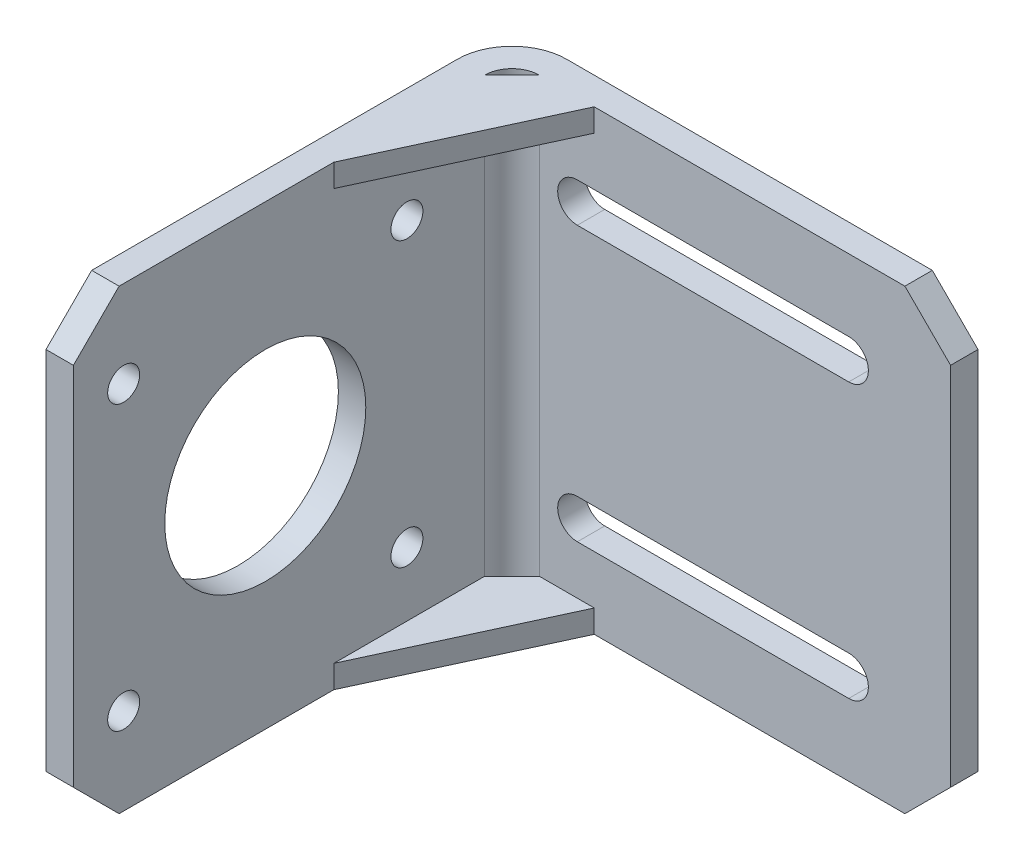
ISO-10303-21;
HEADER;
FILE_DESCRIPTION(('STEP AP214'),'2;1');
FILE_NAME('part.step','',(''),(''),'','','');
FILE_SCHEMA(('AUTOMOTIVE_DESIGN { 1 0 10303 214 1 1 1 1 }'));
ENDSEC;
DATA;
#1=APPLICATION_CONTEXT('core data for automotive mechanical design processes');
#2=APPLICATION_PROTOCOL_DEFINITION('international standard','automotive_design',2000,#1);
#3=PRODUCT_CONTEXT('',#1,'mechanical');
#4=PRODUCT('Part','Part','',(#3));
#5=PRODUCT_RELATED_PRODUCT_CATEGORY('part','',(#4));
#6=PRODUCT_DEFINITION_FORMATION('','',#4);
#7=PRODUCT_DEFINITION_CONTEXT('part definition',#1,'design');
#8=PRODUCT_DEFINITION('design','',#6,#7);
#9=PRODUCT_DEFINITION_SHAPE('','',#8);
#10=(LENGTH_UNIT() NAMED_UNIT(*) SI_UNIT(.MILLI.,.METRE.));
#11=(NAMED_UNIT(*) PLANE_ANGLE_UNIT() SI_UNIT($,.RADIAN.));
#12=(NAMED_UNIT(*) SI_UNIT($,.STERADIAN.) SOLID_ANGLE_UNIT());
#13=UNCERTAINTY_MEASURE_WITH_UNIT(LENGTH_MEASURE(1.E-05),#10,'distance_accuracy_value','');
#14=(GEOMETRIC_REPRESENTATION_CONTEXT(3) GLOBAL_UNCERTAINTY_ASSIGNED_CONTEXT((#13)) GLOBAL_UNIT_ASSIGNED_CONTEXT((#10,
#11,#12)) REPRESENTATION_CONTEXT('',''));
#15=CARTESIAN_POINT('',(0.,0.,0.));
#16=DIRECTION('',(0.,0.,1.));
#17=DIRECTION('',(1.,0.,0.));
#18=AXIS2_PLACEMENT_3D('',#15,#16,#17);
#19=CARTESIAN_POINT('',(0.,22.5,0.));
#20=DIRECTION('',(0.,1.,0.));
#21=DIRECTION('',(1.,0.,0.));
#22=AXIS2_PLACEMENT_3D('',#19,#20,#21);
#23=PLANE('',#22);
#24=DIRECTION('',(-0.419058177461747,0.,0.907959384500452));
#25=VECTOR('',#24,1.);
#26=CARTESIAN_POINT('',(12.,22.5,3.));
#27=LINE('',#26,#25);
#28=CARTESIAN_POINT('',(12.,22.5,3.));
#29=VERTEX_POINT('',#28);
#30=CARTESIAN_POINT('',(3.,22.5,22.5));
#31=VERTEX_POINT('',#30);
#32=EDGE_CURVE('E25',#29,#31,#27,.T.);
#33=ORIENTED_EDGE('',*,*,#32,.T.);
#34=DIRECTION('',(0.,0.,-1.));
#35=VECTOR('',#34,1.);
#36=CARTESIAN_POINT('',(3.,22.5,22.5));
#37=LINE('',#36,#35);
#38=CARTESIAN_POINT('',(3.,22.5,6.));
#39=VERTEX_POINT('',#38);
#40=EDGE_CURVE('E530',#31,#39,#37,.T.);
#41=ORIENTED_EDGE('',*,*,#40,.T.);
#42=DIRECTION('',(0.707106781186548,0.,-0.707106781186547));
#43=VECTOR('',#42,1.);
#44=CARTESIAN_POINT('',(3.,22.5,6.));
#45=LINE('',#44,#43);
#46=CARTESIAN_POINT('',(6.,22.5,3.));
#47=VERTEX_POINT('',#46);
#48=EDGE_CURVE('E10',#39,#47,#45,.T.);
#49=ORIENTED_EDGE('',*,*,#48,.T.);
#50=DIRECTION('',(1.,0.,0.));
#51=VECTOR('',#50,1.);
#52=CARTESIAN_POINT('',(6.,22.5,3.));
#53=LINE('',#52,#51);
#54=EDGE_CURVE('E505',#47,#29,#53,.T.);
#55=ORIENTED_EDGE('',*,*,#54,.T.);
#56=EDGE_LOOP('',(#33,#41,#49,#55));
#57=FACE_BOUND('',#56,.T.);
#58=ADVANCED_FACE('F16',(#57),#23,.F.);
#59=CARTESIAN_POINT('',(3.,22.5,6.));
#60=DIRECTION('',(0.707106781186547,0.,0.707106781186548));
#61=DIRECTION('',(0.,-1.,0.));
#62=AXIS2_PLACEMENT_3D('',#59,#60,#61);
#63=PLANE('',#62);
#64=DIRECTION('',(0.707106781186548,0.,-0.707106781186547));
#65=VECTOR('',#64,1.);
#66=CARTESIAN_POINT('',(3.,25.,6.));
#67=LINE('',#66,#65);
#68=CARTESIAN_POINT('',(3.,25.,6.));
#69=VERTEX_POINT('',#68);
#70=CARTESIAN_POINT('',(6.,25.,3.));
#71=VERTEX_POINT('',#70);
#72=EDGE_CURVE('E392',#69,#71,#67,.T.);
#73=ORIENTED_EDGE('',*,*,#72,.T.);
#74=DIRECTION('',(0.,-1.,0.));
#75=VECTOR('',#74,1.);
#76=CARTESIAN_POINT('',(6.,25.,3.));
#77=LINE('',#76,#75);
#78=EDGE_CURVE('E442',#71,#47,#77,.T.);
#79=ORIENTED_EDGE('',*,*,#78,.T.);
#80=ORIENTED_EDGE('',*,*,#48,.F.);
#81=DIRECTION('',(0.,-1.,0.));
#82=VECTOR('',#81,1.);
#83=CARTESIAN_POINT('',(3.,25.,6.));
#84=LINE('',#83,#82);
#85=EDGE_CURVE('E446',#69,#39,#84,.T.);
#86=ORIENTED_EDGE('',*,*,#85,.F.);
#87=EDGE_LOOP('',(#73,#79,#80,#86));
#88=FACE_BOUND('',#87,.T.);
#89=ADVANCED_FACE('F671',(#88),#63,.F.);
#90=CARTESIAN_POINT('',(12.,22.5,3.));
#91=DIRECTION('',(-0.907959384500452,0.,-0.419058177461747));
#92=DIRECTION('',(-0.419058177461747,0.,0.907959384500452));
#93=AXIS2_PLACEMENT_3D('',#90,#91,#92);
#94=PLANE('',#93);
#95=DIRECTION('',(-0.419058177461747,0.,0.907959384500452));
#96=VECTOR('',#95,1.);
#97=CARTESIAN_POINT('',(12.,25.,3.));
#98=LINE('',#97,#96);
#99=CARTESIAN_POINT('',(12.,25.,3.));
#100=VERTEX_POINT('',#99);
#101=CARTESIAN_POINT('',(3.,25.,22.5));
#102=VERTEX_POINT('',#101);
#103=EDGE_CURVE('E381',#100,#102,#98,.T.);
#104=ORIENTED_EDGE('',*,*,#103,.T.);
#105=DIRECTION('',(0.,1.,0.));
#106=VECTOR('',#105,1.);
#107=CARTESIAN_POINT('',(3.,22.5,22.5));
#108=LINE('',#107,#106);
#109=EDGE_CURVE('E534',#31,#102,#108,.T.);
#110=ORIENTED_EDGE('',*,*,#109,.F.);
#111=ORIENTED_EDGE('',*,*,#32,.F.);
#112=DIRECTION('',(0.,1.,0.));
#113=VECTOR('',#112,1.);
#114=CARTESIAN_POINT('',(12.,22.5,3.));
#115=LINE('',#114,#113);
#116=EDGE_CURVE('E628',#29,#100,#115,.T.);
#117=ORIENTED_EDGE('',*,*,#116,.T.);
#118=EDGE_LOOP('',(#104,#110,#111,#117));
#119=FACE_BOUND('',#118,.T.);
#120=ADVANCED_FACE('F657',(#119),#94,.F.);
#121=CARTESIAN_POINT('',(0.,-22.5,0.));
#122=DIRECTION('',(0.,-1.,0.));
#123=DIRECTION('',(0.,0.,-1.));
#124=AXIS2_PLACEMENT_3D('',#121,#122,#123);
#125=PLANE('',#124);
#126=DIRECTION('',(0.,0.,1.));
#127=VECTOR('',#126,1.);
#128=CARTESIAN_POINT('',(3.,-22.5,6.));
#129=LINE('',#128,#127);
#130=CARTESIAN_POINT('',(3.,-22.5,6.));
#131=VERTEX_POINT('',#130);
#132=CARTESIAN_POINT('',(3.,-22.5,22.5));
#133=VERTEX_POINT('',#132);
#134=EDGE_CURVE('E323',#131,#133,#129,.T.);
#135=ORIENTED_EDGE('',*,*,#134,.T.);
#136=DIRECTION('',(0.419058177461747,0.,-0.907959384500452));
#137=VECTOR('',#136,1.);
#138=CARTESIAN_POINT('',(3.,-22.5,22.5));
#139=LINE('',#138,#137);
#140=CARTESIAN_POINT('',(12.,-22.5,3.));
#141=VERTEX_POINT('',#140);
#142=EDGE_CURVE('E19',#133,#141,#139,.T.);
#143=ORIENTED_EDGE('',*,*,#142,.T.);
#144=DIRECTION('',(-1.,0.,0.));
#145=VECTOR('',#144,1.);
#146=CARTESIAN_POINT('',(12.,-22.5,3.));
#147=LINE('',#146,#145);
#148=CARTESIAN_POINT('',(6.,-22.5,3.));
#149=VERTEX_POINT('',#148);
#150=EDGE_CURVE('E479',#141,#149,#147,.T.);
#151=ORIENTED_EDGE('',*,*,#150,.T.);
#152=DIRECTION('',(-0.707106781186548,0.,0.707106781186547));
#153=VECTOR('',#152,1.);
#154=CARTESIAN_POINT('',(6.,-22.5,3.));
#155=LINE('',#154,#153);
#156=EDGE_CURVE('E431',#149,#131,#155,.T.);
#157=ORIENTED_EDGE('',*,*,#156,.T.);
#158=EDGE_LOOP('',(#135,#143,#151,#157));
#159=FACE_BOUND('',#158,.T.);
#160=ADVANCED_FACE('F477',(#159),#125,.F.);
#161=CARTESIAN_POINT('',(6.,-22.5,3.));
#162=DIRECTION('',(0.707106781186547,0.,0.707106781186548));
#163=DIRECTION('',(0.,-1.,0.));
#164=AXIS2_PLACEMENT_3D('',#161,#162,#163);
#165=PLANE('',#164);
#166=DIRECTION('',(-0.707106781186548,0.,0.707106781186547));
#167=VECTOR('',#166,1.);
#168=CARTESIAN_POINT('',(6.,-25.,3.));
#169=LINE('',#168,#167);
#170=CARTESIAN_POINT('',(6.,-25.,3.));
#171=VERTEX_POINT('',#170);
#172=CARTESIAN_POINT('',(3.,-25.,6.));
#173=VERTEX_POINT('',#172);
#174=EDGE_CURVE('E405',#171,#173,#169,.T.);
#175=ORIENTED_EDGE('',*,*,#174,.T.);
#176=DIRECTION('',(0.,-1.,0.));
#177=VECTOR('',#176,1.);
#178=CARTESIAN_POINT('',(3.,-22.5,6.));
#179=LINE('',#178,#177);
#180=EDGE_CURVE('E299',#131,#173,#179,.T.);
#181=ORIENTED_EDGE('',*,*,#180,.F.);
#182=ORIENTED_EDGE('',*,*,#156,.F.);
#183=DIRECTION('',(0.,-1.,0.));
#184=VECTOR('',#183,1.);
#185=CARTESIAN_POINT('',(6.,-22.5,3.));
#186=LINE('',#185,#184);
#187=EDGE_CURVE('E439',#149,#171,#186,.T.);
#188=ORIENTED_EDGE('',*,*,#187,.T.);
#189=EDGE_LOOP('',(#175,#181,#182,#188));
#190=FACE_BOUND('',#189,.T.);
#191=ADVANCED_FACE('F693',(#190),#165,.F.);
#192=CARTESIAN_POINT('',(3.,-22.5,22.5));
#193=DIRECTION('',(-0.907959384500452,0.,-0.419058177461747));
#194=DIRECTION('',(-0.419058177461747,0.,0.907959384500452));
#195=AXIS2_PLACEMENT_3D('',#192,#193,#194);
#196=PLANE('',#195);
#197=DIRECTION('',(0.419058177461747,0.,-0.907959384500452));
#198=VECTOR('',#197,1.);
#199=CARTESIAN_POINT('',(3.,-25.,22.5));
#200=LINE('',#199,#198);
#201=CARTESIAN_POINT('',(3.,-25.,22.5));
#202=VERTEX_POINT('',#201);
#203=CARTESIAN_POINT('',(12.,-25.,3.));
#204=VERTEX_POINT('',#203);
#205=EDGE_CURVE('E330',#202,#204,#200,.T.);
#206=ORIENTED_EDGE('',*,*,#205,.T.);
#207=DIRECTION('',(0.,-1.,0.));
#208=VECTOR('',#207,1.);
#209=CARTESIAN_POINT('',(12.,-22.5,3.));
#210=LINE('',#209,#208);
#211=EDGE_CURVE('E486',#141,#204,#210,.T.);
#212=ORIENTED_EDGE('',*,*,#211,.F.);
#213=ORIENTED_EDGE('',*,*,#142,.F.);
#214=DIRECTION('',(0.,-1.,0.));
#215=VECTOR('',#214,1.);
#216=CARTESIAN_POINT('',(3.,-22.5,22.5));
#217=LINE('',#216,#215);
#218=EDGE_CURVE('E575',#133,#202,#217,.T.);
#219=ORIENTED_EDGE('',*,*,#218,.T.);
#220=EDGE_LOOP('',(#206,#212,#213,#219));
#221=FACE_BOUND('',#220,.T.);
#222=ADVANCED_FACE('F487',(#221),#196,.F.);
#223=CARTESIAN_POINT('',(10.15,15.,-84.7610391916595));
#224=DIRECTION('',(0.,0.,1.));
#225=DIRECTION('',(1.,0.,0.));
#226=AXIS2_PLACEMENT_3D('',#223,#224,#225);
#227=CYLINDRICAL_SURFACE('',#226,2.15);
#228=DIRECTION('',(0.,0.,1.));
#229=VECTOR('',#228,1.);
#230=CARTESIAN_POINT('',(10.15,17.15,-84.7610391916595));
#231=LINE('',#230,#229);
#232=CARTESIAN_POINT('',(10.15,17.15,0.));
#233=VERTEX_POINT('',#232);
#234=CARTESIAN_POINT('',(10.15,17.15,3.));
#235=VERTEX_POINT('',#234);
#236=EDGE_CURVE('E463',#233,#235,#231,.T.);
#237=ORIENTED_EDGE('',*,*,#236,.T.);
#238=CARTESIAN_POINT('',(10.15,15.,3.));
#239=DIRECTION('',(0.,0.,-1.));
#240=DIRECTION('',(0.,-1.,0.));
#241=AXIS2_PLACEMENT_3D('',#238,#239,#240);
#242=CIRCLE('',#241,2.15);
#243=CARTESIAN_POINT('',(10.15,12.85,3.));
#244=VERTEX_POINT('',#243);
#245=EDGE_CURVE('E641',#244,#235,#242,.T.);
#246=ORIENTED_EDGE('',*,*,#245,.F.);
#247=DIRECTION('',(0.,0.,1.));
#248=VECTOR('',#247,1.);
#249=CARTESIAN_POINT('',(10.15,12.85,-84.7610391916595));
#250=LINE('',#249,#248);
#251=CARTESIAN_POINT('',(10.15,12.85,0.));
#252=VERTEX_POINT('',#251);
#253=EDGE_CURVE('E363',#252,#244,#250,.T.);
#254=ORIENTED_EDGE('',*,*,#253,.F.);
#255=CARTESIAN_POINT('',(10.15,15.,0.));
#256=DIRECTION('',(0.,0.,1.));
#257=DIRECTION('',(-1.,0.,0.));
#258=AXIS2_PLACEMENT_3D('',#255,#256,#257);
#259=CIRCLE('',#258,2.15);
#260=EDGE_CURVE('E372',#233,#252,#259,.T.);
#261=ORIENTED_EDGE('',*,*,#260,.F.);
#262=EDGE_LOOP('',(#237,#246,#254,#261));
#263=FACE_BOUND('',#262,.T.);
#264=ADVANCED_FACE('F699',(#263),#227,.F.);
#265=CARTESIAN_POINT('',(10.15,17.15,-84.7610391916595));
#266=DIRECTION('',(0.,-1.,0.));
#267=DIRECTION('',(-1.,0.,0.));
#268=AXIS2_PLACEMENT_3D('',#265,#266,#267);
#269=PLANE('',#268);
#270=DIRECTION('',(0.,0.,1.));
#271=VECTOR('',#270,1.);
#272=CARTESIAN_POINT('',(39.85,17.15,-84.7610391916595));
#273=LINE('',#272,#271);
#274=CARTESIAN_POINT('',(39.85,17.15,0.));
#275=VERTEX_POINT('',#274);
#276=CARTESIAN_POINT('',(39.85,17.15,3.));
#277=VERTEX_POINT('',#276);
#278=EDGE_CURVE('E461',#275,#277,#273,.T.);
#279=ORIENTED_EDGE('',*,*,#278,.T.);
#280=DIRECTION('',(1.,0.,0.));
#281=VECTOR('',#280,1.);
#282=CARTESIAN_POINT('',(10.15,17.15,3.));
#283=LINE('',#282,#281);
#284=EDGE_CURVE('E630',#235,#277,#283,.T.);
#285=ORIENTED_EDGE('',*,*,#284,.F.);
#286=ORIENTED_EDGE('',*,*,#236,.F.);
#287=DIRECTION('',(-1.,0.,0.));
#288=VECTOR('',#287,1.);
#289=CARTESIAN_POINT('',(0.,17.15,0.));
#290=LINE('',#289,#288);
#291=EDGE_CURVE('E368',#275,#233,#290,.T.);
#292=ORIENTED_EDGE('',*,*,#291,.F.);
#293=EDGE_LOOP('',(#279,#285,#286,#292));
#294=FACE_BOUND('',#293,.T.);
#295=ADVANCED_FACE('F702',(#294),#269,.T.);
#296=CARTESIAN_POINT('',(39.85,15.,-84.7610391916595));
#297=DIRECTION('',(0.,0.,1.));
#298=DIRECTION('',(1.,0.,0.));
#299=AXIS2_PLACEMENT_3D('',#296,#297,#298);
#300=CYLINDRICAL_SURFACE('',#299,2.15);
#301=DIRECTION('',(0.,0.,1.));
#302=VECTOR('',#301,1.);
#303=CARTESIAN_POINT('',(39.85,12.85,-84.7610391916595));
#304=LINE('',#303,#302);
#305=CARTESIAN_POINT('',(39.85,12.85,0.));
#306=VERTEX_POINT('',#305);
#307=CARTESIAN_POINT('',(39.85,12.85,3.));
#308=VERTEX_POINT('',#307);
#309=EDGE_CURVE('E366',#306,#308,#304,.T.);
#310=ORIENTED_EDGE('',*,*,#309,.T.);
#311=CARTESIAN_POINT('',(39.85,15.,3.));
#312=DIRECTION('',(0.,0.,-1.));
#313=DIRECTION('',(0.,1.,0.));
#314=AXIS2_PLACEMENT_3D('',#311,#312,#313);
#315=CIRCLE('',#314,2.15);
#316=EDGE_CURVE('E627',#277,#308,#315,.T.);
#317=ORIENTED_EDGE('',*,*,#316,.F.);
#318=ORIENTED_EDGE('',*,*,#278,.F.);
#319=CARTESIAN_POINT('',(39.85,15.,0.));
#320=DIRECTION('',(0.,0.,1.));
#321=DIRECTION('',(-1.,0.,0.));
#322=AXIS2_PLACEMENT_3D('',#319,#320,#321);
#323=CIRCLE('',#322,2.15);
#324=EDGE_CURVE('E373',#306,#275,#323,.T.);
#325=ORIENTED_EDGE('',*,*,#324,.F.);
#326=EDGE_LOOP('',(#310,#317,#318,#325));
#327=FACE_BOUND('',#326,.T.);
#328=ADVANCED_FACE('F705',(#327),#300,.F.);
#329=CARTESIAN_POINT('',(10.15,12.85,-84.7610391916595));
#330=DIRECTION('',(0.,-1.,0.));
#331=DIRECTION('',(-1.,0.,0.));
#332=AXIS2_PLACEMENT_3D('',#329,#330,#331);
#333=PLANE('',#332);
#334=DIRECTION('',(-1.,0.,0.));
#335=VECTOR('',#334,1.);
#336=CARTESIAN_POINT('',(0.,12.85,0.));
#337=LINE('',#336,#335);
#338=EDGE_CURVE('E362',#306,#252,#337,.T.);
#339=ORIENTED_EDGE('',*,*,#338,.T.);
#340=ORIENTED_EDGE('',*,*,#253,.T.);
#341=DIRECTION('',(1.,0.,0.));
#342=VECTOR('',#341,1.);
#343=CARTESIAN_POINT('',(10.15,12.85,3.));
#344=LINE('',#343,#342);
#345=EDGE_CURVE('E634',#244,#308,#344,.T.);
#346=ORIENTED_EDGE('',*,*,#345,.T.);
#347=ORIENTED_EDGE('',*,*,#309,.F.);
#348=EDGE_LOOP('',(#339,#340,#346,#347));
#349=FACE_BOUND('',#348,.T.);
#350=ADVANCED_FACE('F709',(#349),#333,.F.);
#351=CARTESIAN_POINT('',(10.15,-15.,-84.7610391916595));
#352=DIRECTION('',(0.,0.,1.));
#353=DIRECTION('',(1.,0.,0.));
#354=AXIS2_PLACEMENT_3D('',#351,#352,#353);
#355=CYLINDRICAL_SURFACE('',#354,2.15);
#356=DIRECTION('',(0.,0.,1.));
#357=VECTOR('',#356,1.);
#358=CARTESIAN_POINT('',(10.15,-12.85,-84.7610391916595));
#359=LINE('',#358,#357);
#360=CARTESIAN_POINT('',(10.15,-12.85,0.));
#361=VERTEX_POINT('',#360);
#362=CARTESIAN_POINT('',(10.15,-12.85,3.));
#363=VERTEX_POINT('',#362);
#364=EDGE_CURVE('E367',#361,#363,#359,.T.);
#365=ORIENTED_EDGE('',*,*,#364,.T.);
#366=CARTESIAN_POINT('',(10.15,-15.,3.));
#367=DIRECTION('',(0.,0.,-1.));
#368=DIRECTION('',(0.,-1.,0.));
#369=AXIS2_PLACEMENT_3D('',#366,#367,#368);
#370=CIRCLE('',#369,2.15);
#371=CARTESIAN_POINT('',(10.15,-17.15,3.));
#372=VERTEX_POINT('',#371);
#373=EDGE_CURVE('E292',#372,#363,#370,.T.);
#374=ORIENTED_EDGE('',*,*,#373,.F.);
#375=DIRECTION('',(0.,0.,1.));
#376=VECTOR('',#375,1.);
#377=CARTESIAN_POINT('',(10.15,-17.15,-84.7610391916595));
#378=LINE('',#377,#376);
#379=CARTESIAN_POINT('',(10.15,-17.15,0.));
#380=VERTEX_POINT('',#379);
#381=EDGE_CURVE('E286',#380,#372,#378,.T.);
#382=ORIENTED_EDGE('',*,*,#381,.F.);
#383=CARTESIAN_POINT('',(10.15,-15.,0.));
#384=DIRECTION('',(0.,0.,1.));
#385=DIRECTION('',(-1.,0.,0.));
#386=AXIS2_PLACEMENT_3D('',#383,#384,#385);
#387=CIRCLE('',#386,2.15);
#388=EDGE_CURVE('E289',#361,#380,#387,.T.);
#389=ORIENTED_EDGE('',*,*,#388,.F.);
#390=EDGE_LOOP('',(#365,#374,#382,#389));
#391=FACE_BOUND('',#390,.T.);
#392=ADVANCED_FACE('F288',(#391),#355,.F.);
#393=CARTESIAN_POINT('',(10.15,-12.85,-84.7610391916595));
#394=DIRECTION('',(0.,-1.,0.));
#395=DIRECTION('',(0.,0.,-1.));
#396=AXIS2_PLACEMENT_3D('',#393,#394,#395);
#397=PLANE('',#396);
#398=DIRECTION('',(0.,0.,1.));
#399=VECTOR('',#398,1.);
#400=CARTESIAN_POINT('',(39.85,-12.85,-84.7610391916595));
#401=LINE('',#400,#399);
#402=CARTESIAN_POINT('',(39.85,-12.85,0.));
#403=VERTEX_POINT('',#402);
#404=CARTESIAN_POINT('',(39.85,-12.85,3.));
#405=VERTEX_POINT('',#404);
#406=EDGE_CURVE('E454',#403,#405,#401,.T.);
#407=ORIENTED_EDGE('',*,*,#406,.T.);
#408=DIRECTION('',(1.,0.,0.));
#409=VECTOR('',#408,1.);
#410=CARTESIAN_POINT('',(10.15,-12.85,3.));
#411=LINE('',#410,#409);
#412=EDGE_CURVE('E623',#363,#405,#411,.T.);
#413=ORIENTED_EDGE('',*,*,#412,.F.);
#414=ORIENTED_EDGE('',*,*,#364,.F.);
#415=DIRECTION('',(-1.,0.,0.));
#416=VECTOR('',#415,1.);
#417=CARTESIAN_POINT('',(0.,-12.85,0.));
#418=LINE('',#417,#416);
#419=EDGE_CURVE('E307',#403,#361,#418,.T.);
#420=ORIENTED_EDGE('',*,*,#419,.F.);
#421=EDGE_LOOP('',(#407,#413,#414,#420));
#422=FACE_BOUND('',#421,.T.);
#423=ADVANCED_FACE('F714',(#422),#397,.T.);
#424=CARTESIAN_POINT('',(39.85,-15.,-84.7610391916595));
#425=DIRECTION('',(0.,0.,1.));
#426=DIRECTION('',(1.,0.,0.));
#427=AXIS2_PLACEMENT_3D('',#424,#425,#426);
#428=CYLINDRICAL_SURFACE('',#427,2.15);
#429=DIRECTION('',(0.,0.,1.));
#430=VECTOR('',#429,1.);
#431=CARTESIAN_POINT('',(39.85,-17.15,-84.7610391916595));
#432=LINE('',#431,#430);
#433=CARTESIAN_POINT('',(39.85,-17.15,0.));
#434=VERTEX_POINT('',#433);
#435=CARTESIAN_POINT('',(39.85,-17.15,3.));
#436=VERTEX_POINT('',#435);
#437=EDGE_CURVE('E298',#434,#436,#432,.T.);
#438=ORIENTED_EDGE('',*,*,#437,.T.);
#439=CARTESIAN_POINT('',(39.85,-15.,3.));
#440=DIRECTION('',(0.,0.,-1.));
#441=DIRECTION('',(0.,1.,0.));
#442=AXIS2_PLACEMENT_3D('',#439,#440,#441);
#443=CIRCLE('',#442,2.15);
#444=EDGE_CURVE('E1000',#405,#436,#443,.T.);
#445=ORIENTED_EDGE('',*,*,#444,.F.);
#446=ORIENTED_EDGE('',*,*,#406,.F.);
#447=CARTESIAN_POINT('',(39.85,-15.,0.));
#448=DIRECTION('',(0.,0.,1.));
#449=DIRECTION('',(-1.,0.,0.));
#450=AXIS2_PLACEMENT_3D('',#447,#448,#449);
#451=CIRCLE('',#450,2.15);
#452=EDGE_CURVE('E314',#434,#403,#451,.T.);
#453=ORIENTED_EDGE('',*,*,#452,.F.);
#454=EDGE_LOOP('',(#438,#445,#446,#453));
#455=FACE_BOUND('',#454,.T.);
#456=ADVANCED_FACE('F717',(#455),#428,.F.);
#457=CARTESIAN_POINT('',(10.15,-17.15,-84.7610391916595));
#458=DIRECTION('',(0.,-1.,0.));
#459=DIRECTION('',(0.,0.,-1.));
#460=AXIS2_PLACEMENT_3D('',#457,#458,#459);
#461=PLANE('',#460);
#462=DIRECTION('',(-1.,0.,0.));
#463=VECTOR('',#462,1.);
#464=CARTESIAN_POINT('',(0.,-17.15,0.));
#465=LINE('',#464,#463);
#466=EDGE_CURVE('E305',#434,#380,#465,.T.);
#467=ORIENTED_EDGE('',*,*,#466,.T.);
#468=ORIENTED_EDGE('',*,*,#381,.T.);
#469=DIRECTION('',(1.,0.,0.));
#470=VECTOR('',#469,1.);
#471=CARTESIAN_POINT('',(10.15,-17.15,3.));
#472=LINE('',#471,#470);
#473=EDGE_CURVE('E1002',#372,#436,#472,.T.);
#474=ORIENTED_EDGE('',*,*,#473,.T.);
#475=ORIENTED_EDGE('',*,*,#437,.F.);
#476=EDGE_LOOP('',(#467,#468,#474,#475));
#477=FACE_BOUND('',#476,.T.);
#478=ADVANCED_FACE('F311',(#477),#461,.F.);
#479=CARTESIAN_POINT('',(0.,20.,51.));
#480=DIRECTION('',(0.,0.707106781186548,0.707106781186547));
#481=DIRECTION('',(1.,0.,0.));
#482=AXIS2_PLACEMENT_3D('',#479,#480,#481);
#483=PLANE('',#482);
#484=DIRECTION('',(0.,-0.707106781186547,0.707106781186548));
#485=VECTOR('',#484,1.);
#486=CARTESIAN_POINT('',(3.,20.,51.));
#487=LINE('',#486,#485);
#488=CARTESIAN_POINT('',(3.,25.,46.));
#489=VERTEX_POINT('',#488);
#490=CARTESIAN_POINT('',(3.,20.,51.));
#491=VERTEX_POINT('',#490);
#492=EDGE_CURVE('E545',#489,#491,#487,.T.);
#493=ORIENTED_EDGE('',*,*,#492,.F.);
#494=DIRECTION('',(1.,0.,0.));
#495=VECTOR('',#494,1.);
#496=CARTESIAN_POINT('',(0.,25.,46.));
#497=LINE('',#496,#495);
#498=CARTESIAN_POINT('',(0.,25.,46.));
#499=VERTEX_POINT('',#498);
#500=EDGE_CURVE('E344',#499,#489,#497,.T.);
#501=ORIENTED_EDGE('',*,*,#500,.F.);
#502=DIRECTION('',(0.,0.707106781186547,-0.707106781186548));
#503=VECTOR('',#502,1.);
#504=CARTESIAN_POINT('',(0.,48.,23.));
#505=LINE('',#504,#503);
#506=CARTESIAN_POINT('',(0.,20.,51.));
#507=VERTEX_POINT('',#506);
#508=EDGE_CURVE('E438',#507,#499,#505,.T.);
#509=ORIENTED_EDGE('',*,*,#508,.F.);
#510=DIRECTION('',(-1.,0.,0.));
#511=VECTOR('',#510,1.);
#512=CARTESIAN_POINT('',(0.,20.,51.));
#513=LINE('',#512,#511);
#514=EDGE_CURVE('E423',#491,#507,#513,.T.);
#515=ORIENTED_EDGE('',*,*,#514,.F.);
#516=EDGE_LOOP('',(#493,#501,#509,#515));
#517=FACE_BOUND('',#516,.T.);
#518=ADVANCED_FACE('F726',(#517),#483,.T.);
#519=CARTESIAN_POINT('',(0.,-25.,46.));
#520=DIRECTION('',(0.,0.707106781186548,-0.707106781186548));
#521=DIRECTION('',(-1.,0.,0.));
#522=AXIS2_PLACEMENT_3D('',#519,#520,#521);
#523=PLANE('',#522);
#524=DIRECTION('',(0.,-0.707106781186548,-0.707106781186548));
#525=VECTOR('',#524,1.);
#526=CARTESIAN_POINT('',(3.,-25.,46.));
#527=LINE('',#526,#525);
#528=CARTESIAN_POINT('',(3.,-20.,51.));
#529=VERTEX_POINT('',#528);
#530=CARTESIAN_POINT('',(3.,-25.,46.));
#531=VERTEX_POINT('',#530);
#532=EDGE_CURVE('E562',#529,#531,#527,.T.);
#533=ORIENTED_EDGE('',*,*,#532,.F.);
#534=DIRECTION('',(1.,0.,0.));
#535=VECTOR('',#534,1.);
#536=CARTESIAN_POINT('',(0.,-20.,51.));
#537=LINE('',#536,#535);
#538=CARTESIAN_POINT('',(0.,-20.,51.));
#539=VERTEX_POINT('',#538);
#540=EDGE_CURVE('E420',#539,#529,#537,.T.);
#541=ORIENTED_EDGE('',*,*,#540,.F.);
#542=DIRECTION('',(0.,0.707106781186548,0.707106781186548));
#543=VECTOR('',#542,1.);
#544=CARTESIAN_POINT('',(0.,-23.,48.));
#545=LINE('',#544,#543);
#546=CARTESIAN_POINT('',(0.,-25.,46.));
#547=VERTEX_POINT('',#546);
#548=EDGE_CURVE('E426',#547,#539,#545,.T.);
#549=ORIENTED_EDGE('',*,*,#548,.F.);
#550=DIRECTION('',(-1.,0.,0.));
#551=VECTOR('',#550,1.);
#552=CARTESIAN_POINT('',(0.,-25.,46.));
#553=LINE('',#552,#551);
#554=EDGE_CURVE('E333',#531,#547,#553,.T.);
#555=ORIENTED_EDGE('',*,*,#554,.F.);
#556=EDGE_LOOP('',(#533,#541,#549,#555));
#557=FACE_BOUND('',#556,.T.);
#558=ADVANCED_FACE('F729',(#557),#523,.F.);
#559=CARTESIAN_POINT('',(51.,-20.,0.));
#560=DIRECTION('',(0.707106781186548,-0.707106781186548,0.));
#561=DIRECTION('',(0.,0.,-1.));
#562=AXIS2_PLACEMENT_3D('',#559,#560,#561);
#563=PLANE('',#562);
#564=DIRECTION('',(0.707106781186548,0.707106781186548,0.));
#565=VECTOR('',#564,1.);
#566=CARTESIAN_POINT('',(51.,-20.,3.));
#567=LINE('',#566,#565);
#568=CARTESIAN_POINT('',(46.,-25.,3.));
#569=VERTEX_POINT('',#568);
#570=CARTESIAN_POINT('',(51.,-20.,3.));
#571=VERTEX_POINT('',#570);
#572=EDGE_CURVE('E610',#569,#571,#567,.T.);
#573=ORIENTED_EDGE('',*,*,#572,.F.);
#574=DIRECTION('',(0.,0.,1.));
#575=VECTOR('',#574,1.);
#576=CARTESIAN_POINT('',(46.,-25.,0.));
#577=LINE('',#576,#575);
#578=CARTESIAN_POINT('',(46.,-25.,0.));
#579=VERTEX_POINT('',#578);
#580=EDGE_CURVE('E410',#579,#569,#577,.T.);
#581=ORIENTED_EDGE('',*,*,#580,.F.);
#582=DIRECTION('',(-0.707106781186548,-0.707106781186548,0.));
#583=VECTOR('',#582,1.);
#584=CARTESIAN_POINT('',(48.,-23.,0.));
#585=LINE('',#584,#583);
#586=CARTESIAN_POINT('',(51.,-20.,0.));
#587=VERTEX_POINT('',#586);
#588=EDGE_CURVE('E353',#587,#579,#585,.T.);
#589=ORIENTED_EDGE('',*,*,#588,.F.);
#590=DIRECTION('',(0.,0.,-1.));
#591=VECTOR('',#590,1.);
#592=CARTESIAN_POINT('',(51.,-20.,0.));
#593=LINE('',#592,#591);
#594=EDGE_CURVE('E334',#571,#587,#593,.T.);
#595=ORIENTED_EDGE('',*,*,#594,.F.);
#596=EDGE_LOOP('',(#573,#581,#589,#595));
#597=FACE_BOUND('',#596,.T.);
#598=ADVANCED_FACE('F596',(#597),#563,.T.);
#599=CARTESIAN_POINT('',(46.,25.,0.));
#600=DIRECTION('',(-0.707106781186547,-0.707106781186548,0.));
#601=DIRECTION('',(-0.707106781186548,0.707106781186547,0.));
#602=AXIS2_PLACEMENT_3D('',#599,#600,#601);
#603=PLANE('',#602);
#604=DIRECTION('',(-0.707106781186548,0.707106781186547,0.));
#605=VECTOR('',#604,1.);
#606=CARTESIAN_POINT('',(46.,25.,3.));
#607=LINE('',#606,#605);
#608=CARTESIAN_POINT('',(51.,20.,3.));
#609=VERTEX_POINT('',#608);
#610=CARTESIAN_POINT('',(46.,25.,3.));
#611=VERTEX_POINT('',#610);
#612=EDGE_CURVE('E511',#609,#611,#607,.T.);
#613=ORIENTED_EDGE('',*,*,#612,.F.);
#614=DIRECTION('',(0.,0.,1.));
#615=VECTOR('',#614,1.);
#616=CARTESIAN_POINT('',(51.,20.,0.));
#617=LINE('',#616,#615);
#618=CARTESIAN_POINT('',(51.,20.,0.));
#619=VERTEX_POINT('',#618);
#620=EDGE_CURVE('E396',#619,#609,#617,.T.);
#621=ORIENTED_EDGE('',*,*,#620,.F.);
#622=DIRECTION('',(0.707106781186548,-0.707106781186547,0.));
#623=VECTOR('',#622,1.);
#624=CARTESIAN_POINT('',(23.,48.,0.));
#625=LINE('',#624,#623);
#626=CARTESIAN_POINT('',(46.,25.,0.));
#627=VERTEX_POINT('',#626);
#628=EDGE_CURVE('E338',#627,#619,#625,.T.);
#629=ORIENTED_EDGE('',*,*,#628,.F.);
#630=DIRECTION('',(0.,0.,-1.));
#631=VECTOR('',#630,1.);
#632=CARTESIAN_POINT('',(46.,25.,0.));
#633=LINE('',#632,#631);
#634=EDGE_CURVE('E377',#611,#627,#633,.T.);
#635=ORIENTED_EDGE('',*,*,#634,.F.);
#636=EDGE_LOOP('',(#613,#621,#629,#635));
#637=FACE_BOUND('',#636,.T.);
#638=ADVANCED_FACE('F587',(#637),#603,.F.);
#639=CARTESIAN_POINT('',(87.7610391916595,15.5,14.5));
#640=DIRECTION('',(-1.,0.,0.));
#641=DIRECTION('',(0.,0.,1.));
#642=AXIS2_PLACEMENT_3D('',#639,#640,#641);
#643=CYLINDRICAL_SURFACE('',#642,1.75);
#644=CARTESIAN_POINT('',(0.,15.5,14.5));
#645=DIRECTION('',(-1.,0.,0.));
#646=DIRECTION('',(0.,-1.,0.));
#647=AXIS2_PLACEMENT_3D('',#644,#645,#646);
#648=CIRCLE('',#647,1.75);
#649=CARTESIAN_POINT('',(0.,13.75,14.5));
#650=VERTEX_POINT('',#649);
#651=EDGE_CURVE('E343',#650,#650,#648,.T.);
#652=ORIENTED_EDGE('',*,*,#651,.T.);
#653=EDGE_LOOP('',(#652));
#654=FACE_BOUND('',#653,.T.);
#655=CARTESIAN_POINT('',(3.,15.5,14.5));
#656=DIRECTION('',(-1.,0.,0.));
#657=DIRECTION('',(0.,0.,1.));
#658=AXIS2_PLACEMENT_3D('',#655,#656,#657);
#659=CIRCLE('',#658,1.75);
#660=CARTESIAN_POINT('',(3.,15.5,16.25));
#661=VERTEX_POINT('',#660);
#662=EDGE_CURVE('E508',#661,#661,#659,.T.);
#663=ORIENTED_EDGE('',*,*,#662,.F.);
#664=EDGE_LOOP('',(#663));
#665=FACE_BOUND('',#664,.T.);
#666=ADVANCED_FACE('F740',(#654,#665),#643,.F.);
#667=CARTESIAN_POINT('',(87.7610391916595,-15.5,14.5));
#668=DIRECTION('',(-1.,0.,0.));
#669=DIRECTION('',(0.,0.,1.));
#670=AXIS2_PLACEMENT_3D('',#667,#668,#669);
#671=CYLINDRICAL_SURFACE('',#670,1.75);
#672=CARTESIAN_POINT('',(0.,-15.5,14.5));
#673=DIRECTION('',(-1.,0.,0.));
#674=DIRECTION('',(0.,-1.,0.));
#675=AXIS2_PLACEMENT_3D('',#672,#673,#674);
#676=CIRCLE('',#675,1.75);
#677=CARTESIAN_POINT('',(0.,-17.25,14.5));
#678=VERTEX_POINT('',#677);
#679=EDGE_CURVE('E339',#678,#678,#676,.T.);
#680=ORIENTED_EDGE('',*,*,#679,.T.);
#681=EDGE_LOOP('',(#680));
#682=FACE_BOUND('',#681,.T.);
#683=CARTESIAN_POINT('',(3.,-15.5,14.5));
#684=DIRECTION('',(-1.,0.,0.));
#685=DIRECTION('',(0.,0.,1.));
#686=AXIS2_PLACEMENT_3D('',#683,#684,#685);
#687=CIRCLE('',#686,1.75);
#688=CARTESIAN_POINT('',(3.,-15.5,16.25));
#689=VERTEX_POINT('',#688);
#690=EDGE_CURVE('E520',#689,#689,#687,.T.);
#691=ORIENTED_EDGE('',*,*,#690,.F.);
#692=EDGE_LOOP('',(#691));
#693=FACE_BOUND('',#692,.T.);
#694=ADVANCED_FACE('F748',(#682,#693),#671,.F.);
#695=CARTESIAN_POINT('',(87.7610391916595,-15.5,45.5));
#696=DIRECTION('',(-1.,0.,0.));
#697=DIRECTION('',(0.,0.,1.));
#698=AXIS2_PLACEMENT_3D('',#695,#696,#697);
#699=CYLINDRICAL_SURFACE('',#698,1.75);
#700=CARTESIAN_POINT('',(0.,-15.5,45.5));
#701=DIRECTION('',(-1.,0.,0.));
#702=DIRECTION('',(0.,-1.,0.));
#703=AXIS2_PLACEMENT_3D('',#700,#701,#702);
#704=CIRCLE('',#703,1.75);
#705=CARTESIAN_POINT('',(0.,-17.25,45.5));
#706=VERTEX_POINT('',#705);
#707=EDGE_CURVE('E342',#706,#706,#704,.T.);
#708=ORIENTED_EDGE('',*,*,#707,.T.);
#709=EDGE_LOOP('',(#708));
#710=FACE_BOUND('',#709,.T.);
#711=CARTESIAN_POINT('',(3.,-15.5,45.5));
#712=DIRECTION('',(-1.,0.,0.));
#713=DIRECTION('',(0.,0.,1.));
#714=AXIS2_PLACEMENT_3D('',#711,#712,#713);
#715=CIRCLE('',#714,1.75);
#716=CARTESIAN_POINT('',(3.,-15.5,47.25));
#717=VERTEX_POINT('',#716);
#718=EDGE_CURVE('E523',#717,#717,#715,.T.);
#719=ORIENTED_EDGE('',*,*,#718,.F.);
#720=EDGE_LOOP('',(#719));
#721=FACE_BOUND('',#720,.T.);
#722=ADVANCED_FACE('F745',(#710,#721),#699,.F.);
#723=CARTESIAN_POINT('',(87.7610391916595,15.5,45.5));
#724=DIRECTION('',(-1.,0.,0.));
#725=DIRECTION('',(0.,0.,1.));
#726=AXIS2_PLACEMENT_3D('',#723,#724,#725);
#727=CYLINDRICAL_SURFACE('',#726,1.75);
#728=CARTESIAN_POINT('',(0.,15.5,45.5));
#729=DIRECTION('',(-1.,0.,0.));
#730=DIRECTION('',(0.,-1.,0.));
#731=AXIS2_PLACEMENT_3D('',#728,#729,#730);
#732=CIRCLE('',#731,1.75);
#733=CARTESIAN_POINT('',(0.,13.75,45.5));
#734=VERTEX_POINT('',#733);
#735=EDGE_CURVE('E43',#734,#734,#732,.T.);
#736=ORIENTED_EDGE('',*,*,#735,.T.);
#737=EDGE_LOOP('',(#736));
#738=FACE_BOUND('',#737,.T.);
#739=CARTESIAN_POINT('',(3.,15.5,45.5));
#740=DIRECTION('',(-1.,0.,0.));
#741=DIRECTION('',(0.,0.,1.));
#742=AXIS2_PLACEMENT_3D('',#739,#740,#741);
#743=CIRCLE('',#742,1.75);
#744=CARTESIAN_POINT('',(3.,15.5,47.25));
#745=VERTEX_POINT('',#744);
#746=EDGE_CURVE('E526',#745,#745,#743,.T.);
#747=ORIENTED_EDGE('',*,*,#746,.F.);
#748=EDGE_LOOP('',(#747));
#749=FACE_BOUND('',#748,.T.);
#750=ADVANCED_FACE('F741',(#738,#749),#727,.F.);
#751=CARTESIAN_POINT('',(87.7610391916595,0.,30.));
#752=DIRECTION('',(-1.,0.,0.));
#753=DIRECTION('',(0.,0.,1.));
#754=AXIS2_PLACEMENT_3D('',#751,#752,#753);
#755=CYLINDRICAL_SURFACE('',#754,11.);
#756=CARTESIAN_POINT('',(0.,0.,30.));
#757=DIRECTION('',(-1.,0.,0.));
#758=DIRECTION('',(0.,-1.,0.));
#759=AXIS2_PLACEMENT_3D('',#756,#757,#758);
#760=CIRCLE('',#759,11.);
#761=CARTESIAN_POINT('',(0.,-11.,30.));
#762=VERTEX_POINT('',#761);
#763=EDGE_CURVE('E36',#762,#762,#760,.T.);
#764=ORIENTED_EDGE('',*,*,#763,.T.);
#765=EDGE_LOOP('',(#764));
#766=FACE_BOUND('',#765,.T.);
#767=CARTESIAN_POINT('',(3.,0.,30.));
#768=DIRECTION('',(-1.,0.,0.));
#769=DIRECTION('',(0.,0.,1.));
#770=AXIS2_PLACEMENT_3D('',#767,#768,#769);
#771=CIRCLE('',#770,11.);
#772=CARTESIAN_POINT('',(3.,0.,41.));
#773=VERTEX_POINT('',#772);
#774=EDGE_CURVE('E527',#773,#773,#771,.T.);
#775=ORIENTED_EDGE('',*,*,#774,.F.);
#776=EDGE_LOOP('',(#775));
#777=FACE_BOUND('',#776,.T.);
#778=ADVANCED_FACE('F744',(#766,#777),#755,.F.);
#779=CARTESIAN_POINT('',(6.,25.,6.));
#780=DIRECTION('',(0.,-1.,0.));
#781=DIRECTION('',(0.,0.,-1.));
#782=AXIS2_PLACEMENT_3D('',#779,#780,#781);
#783=CYLINDRICAL_SURFACE('',#782,3.);
#784=CARTESIAN_POINT('',(6.,-25.,6.));
#785=DIRECTION('',(0.,-1.,0.));
#786=DIRECTION('',(0.,0.,-1.));
#787=AXIS2_PLACEMENT_3D('',#784,#785,#786);
#788=CIRCLE('',#787,3.);
#789=EDGE_CURVE('E409',#173,#171,#788,.T.);
#790=ORIENTED_EDGE('',*,*,#789,.T.);
#791=ORIENTED_EDGE('',*,*,#187,.F.);
#792=DIRECTION('',(0.,-1.,0.));
#793=VECTOR('',#792,1.);
#794=CARTESIAN_POINT('',(6.,25.,3.));
#795=LINE('',#794,#793);
#796=EDGE_CURVE('E499',#47,#149,#795,.T.);
#797=ORIENTED_EDGE('',*,*,#796,.F.);
#798=ORIENTED_EDGE('',*,*,#78,.F.);
#799=CARTESIAN_POINT('',(6.,25.,6.));
#800=DIRECTION('',(0.,-1.,0.));
#801=DIRECTION('',(0.,0.,-1.));
#802=AXIS2_PLACEMENT_3D('',#799,#800,#801);
#803=CIRCLE('',#802,3.);
#804=EDGE_CURVE('E347',#69,#71,#803,.T.);
#805=ORIENTED_EDGE('',*,*,#804,.F.);
#806=ORIENTED_EDGE('',*,*,#85,.T.);
#807=DIRECTION('',(0.,-1.,0.));
#808=VECTOR('',#807,1.);
#809=CARTESIAN_POINT('',(3.,25.,6.));
#810=LINE('',#809,#808);
#811=EDGE_CURVE('E315',#39,#131,#810,.T.);
#812=ORIENTED_EDGE('',*,*,#811,.T.);
#813=ORIENTED_EDGE('',*,*,#180,.T.);
#814=EDGE_LOOP('',(#790,#791,#797,#798,#805,#806,#812,#813));
#815=FACE_BOUND('',#814,.T.);
#816=ADVANCED_FACE('F665',(#815),#783,.F.);
#817=CARTESIAN_POINT('',(6.,25.,6.));
#818=DIRECTION('',(0.,-1.,0.));
#819=DIRECTION('',(0.,0.,-1.));
#820=AXIS2_PLACEMENT_3D('',#817,#818,#819);
#821=CYLINDRICAL_SURFACE('',#820,6.);
#822=CARTESIAN_POINT('',(6.,-25.,6.));
#823=DIRECTION('',(0.,-1.,0.));
#824=DIRECTION('',(0.,0.,1.));
#825=AXIS2_PLACEMENT_3D('',#822,#823,#824);
#826=CIRCLE('',#825,6.);
#827=CARTESIAN_POINT('',(0.,-25.,6.));
#828=VERTEX_POINT('',#827);
#829=CARTESIAN_POINT('',(6.,-25.,0.));
#830=VERTEX_POINT('',#829);
#831=EDGE_CURVE('E411',#828,#830,#826,.T.);
#832=ORIENTED_EDGE('',*,*,#831,.F.);
#833=DIRECTION('',(0.,-1.,0.));
#834=VECTOR('',#833,1.);
#835=CARTESIAN_POINT('',(0.,25.,6.));
#836=LINE('',#835,#834);
#837=CARTESIAN_POINT('',(0.,25.,6.));
#838=VERTEX_POINT('',#837);
#839=EDGE_CURVE('E443',#838,#828,#836,.T.);
#840=ORIENTED_EDGE('',*,*,#839,.F.);
#841=CARTESIAN_POINT('',(6.,25.,6.));
#842=DIRECTION('',(0.,-1.,0.));
#843=DIRECTION('',(0.,0.,1.));
#844=AXIS2_PLACEMENT_3D('',#841,#842,#843);
#845=CIRCLE('',#844,6.);
#846=CARTESIAN_POINT('',(6.,25.,0.));
#847=VERTEX_POINT('',#846);
#848=EDGE_CURVE('E374',#838,#847,#845,.T.);
#849=ORIENTED_EDGE('',*,*,#848,.T.);
#850=DIRECTION('',(0.,-1.,0.));
#851=VECTOR('',#850,1.);
#852=CARTESIAN_POINT('',(6.,25.,0.));
#853=LINE('',#852,#851);
#854=EDGE_CURVE('E358',#847,#830,#853,.T.);
#855=ORIENTED_EDGE('',*,*,#854,.T.);
#856=EDGE_LOOP('',(#832,#840,#849,#855));
#857=FACE_BOUND('',#856,.T.);
#858=ADVANCED_FACE('F603',(#857),#821,.T.);
#859=CARTESIAN_POINT('',(0.,25.,0.));
#860=DIRECTION('',(-1.,0.,0.));
#861=DIRECTION('',(0.,0.,1.));
#862=AXIS2_PLACEMENT_3D('',#859,#860,#861);
#863=PLANE('',#862);
#864=DIRECTION('',(0.,0.,-1.));
#865=VECTOR('',#864,1.);
#866=CARTESIAN_POINT('',(0.,-25.,0.));
#867=LINE('',#866,#865);
#868=EDGE_CURVE('E404',#547,#828,#867,.T.);
#869=ORIENTED_EDGE('',*,*,#868,.F.);
#870=ORIENTED_EDGE('',*,*,#548,.T.);
#871=DIRECTION('',(0.,-1.,0.));
#872=VECTOR('',#871,1.);
#873=CARTESIAN_POINT('',(0.,25.,51.));
#874=LINE('',#873,#872);
#875=EDGE_CURVE('E419',#507,#539,#874,.T.);
#876=ORIENTED_EDGE('',*,*,#875,.F.);
#877=ORIENTED_EDGE('',*,*,#508,.T.);
#878=DIRECTION('',(0.,0.,-1.));
#879=VECTOR('',#878,1.);
#880=CARTESIAN_POINT('',(0.,25.,0.));
#881=LINE('',#880,#879);
#882=EDGE_CURVE('E348',#499,#838,#881,.T.);
#883=ORIENTED_EDGE('',*,*,#882,.T.);
#884=ORIENTED_EDGE('',*,*,#839,.T.);
#885=EDGE_LOOP('',(#869,#870,#876,#877,#883,#884));
#886=FACE_BOUND('',#885,.T.);
#887=ORIENTED_EDGE('',*,*,#763,.F.);
#888=EDGE_LOOP('',(#887));
#889=FACE_BOUND('',#888,.T.);
#890=ORIENTED_EDGE('',*,*,#735,.F.);
#891=EDGE_LOOP('',(#890));
#892=FACE_BOUND('',#891,.T.);
#893=ORIENTED_EDGE('',*,*,#707,.F.);
#894=EDGE_LOOP('',(#893));
#895=FACE_BOUND('',#894,.T.);
#896=ORIENTED_EDGE('',*,*,#679,.F.);
#897=EDGE_LOOP('',(#896));
#898=FACE_BOUND('',#897,.T.);
#899=ORIENTED_EDGE('',*,*,#651,.F.);
#900=EDGE_LOOP('',(#899));
#901=FACE_BOUND('',#900,.T.);
#902=ADVANCED_FACE('F756',(#886,#889,#892,#895,#898,#901),#863,.T.);
#903=CARTESIAN_POINT('',(0.,25.,51.));
#904=DIRECTION('',(0.,0.,-1.));
#905=DIRECTION('',(0.,-1.,0.));
#906=AXIS2_PLACEMENT_3D('',#903,#904,#905);
#907=PLANE('',#906);
#908=ORIENTED_EDGE('',*,*,#875,.T.);
#909=ORIENTED_EDGE('',*,*,#540,.T.);
#910=DIRECTION('',(0.,-1.,0.));
#911=VECTOR('',#910,1.);
#912=CARTESIAN_POINT('',(3.,25.,51.));
#913=LINE('',#912,#911);
#914=EDGE_CURVE('E555',#491,#529,#913,.T.);
#915=ORIENTED_EDGE('',*,*,#914,.F.);
#916=ORIENTED_EDGE('',*,*,#514,.T.);
#917=EDGE_LOOP('',(#908,#909,#915,#916));
#918=FACE_BOUND('',#917,.T.);
#919=ADVANCED_FACE('F759',(#918),#907,.F.);
#920=CARTESIAN_POINT('',(0.,-25.,0.));
#921=DIRECTION('',(0.,1.,0.));
#922=DIRECTION('',(1.,0.,0.));
#923=AXIS2_PLACEMENT_3D('',#920,#921,#922);
#924=PLANE('',#923);
#925=ORIENTED_EDGE('',*,*,#174,.F.);
#926=ORIENTED_EDGE('',*,*,#789,.F.);
#927=EDGE_LOOP('',(#925,#926));
#928=FACE_BOUND('',#927,.T.);
#929=DIRECTION('',(1.,0.,0.));
#930=VECTOR('',#929,1.);
#931=CARTESIAN_POINT('',(0.,-25.,3.));
#932=LINE('',#931,#930);
#933=EDGE_CURVE('E492',#204,#569,#932,.T.);
#934=ORIENTED_EDGE('',*,*,#933,.F.);
#935=ORIENTED_EDGE('',*,*,#205,.F.);
#936=DIRECTION('',(0.,0.,-1.));
#937=VECTOR('',#936,1.);
#938=CARTESIAN_POINT('',(3.,-25.,0.));
#939=LINE('',#938,#937);
#940=EDGE_CURVE('E569',#531,#202,#939,.T.);
#941=ORIENTED_EDGE('',*,*,#940,.F.);
#942=ORIENTED_EDGE('',*,*,#554,.T.);
#943=ORIENTED_EDGE('',*,*,#868,.T.);
#944=ORIENTED_EDGE('',*,*,#831,.T.);
#945=DIRECTION('',(1.,0.,0.));
#946=VECTOR('',#945,1.);
#947=CARTESIAN_POINT('',(0.,-25.,0.));
#948=LINE('',#947,#946);
#949=EDGE_CURVE('E354',#830,#579,#948,.T.);
#950=ORIENTED_EDGE('',*,*,#949,.T.);
#951=ORIENTED_EDGE('',*,*,#580,.T.);
#952=EDGE_LOOP('',(#934,#935,#941,#942,#943,#944,#950,#951));
#953=FACE_BOUND('',#952,.T.);
#954=ADVANCED_FACE('F599',(#928,#953),#924,.F.);
#955=CARTESIAN_POINT('',(51.,25.,0.));
#956=DIRECTION('',(1.,0.,0.));
#957=DIRECTION('',(0.,1.,0.));
#958=AXIS2_PLACEMENT_3D('',#955,#956,#957);
#959=PLANE('',#958);
#960=DIRECTION('',(0.,-1.,0.));
#961=VECTOR('',#960,1.);
#962=CARTESIAN_POINT('',(51.,25.,0.));
#963=LINE('',#962,#961);
#964=EDGE_CURVE('E349',#619,#587,#963,.T.);
#965=ORIENTED_EDGE('',*,*,#964,.F.);
#966=ORIENTED_EDGE('',*,*,#620,.T.);
#967=DIRECTION('',(0.,-1.,0.));
#968=VECTOR('',#967,1.);
#969=CARTESIAN_POINT('',(51.,25.,3.));
#970=LINE('',#969,#968);
#971=EDGE_CURVE('E516',#609,#571,#970,.T.);
#972=ORIENTED_EDGE('',*,*,#971,.T.);
#973=ORIENTED_EDGE('',*,*,#594,.T.);
#974=EDGE_LOOP('',(#965,#966,#972,#973));
#975=FACE_BOUND('',#974,.T.);
#976=ADVANCED_FACE('F591',(#975),#959,.T.);
#977=CARTESIAN_POINT('',(0.,25.,0.));
#978=DIRECTION('',(0.,1.,0.));
#979=DIRECTION('',(1.,0.,0.));
#980=AXIS2_PLACEMENT_3D('',#977,#978,#979);
#981=PLANE('',#980);
#982=ORIENTED_EDGE('',*,*,#804,.T.);
#983=ORIENTED_EDGE('',*,*,#72,.F.);
#984=EDGE_LOOP('',(#982,#983));
#985=FACE_BOUND('',#984,.T.);
#986=ORIENTED_EDGE('',*,*,#103,.F.);
#987=DIRECTION('',(1.,0.,0.));
#988=VECTOR('',#987,1.);
#989=CARTESIAN_POINT('',(0.,25.,3.));
#990=LINE('',#989,#988);
#991=EDGE_CURVE('E515',#100,#611,#990,.T.);
#992=ORIENTED_EDGE('',*,*,#991,.T.);
#993=ORIENTED_EDGE('',*,*,#634,.T.);
#994=DIRECTION('',(1.,0.,0.));
#995=VECTOR('',#994,1.);
#996=CARTESIAN_POINT('',(0.,25.,0.));
#997=LINE('',#996,#995);
#998=EDGE_CURVE('E309',#847,#627,#997,.T.);
#999=ORIENTED_EDGE('',*,*,#998,.F.);
#1000=ORIENTED_EDGE('',*,*,#848,.F.);
#1001=ORIENTED_EDGE('',*,*,#882,.F.);
#1002=ORIENTED_EDGE('',*,*,#500,.T.);
#1003=DIRECTION('',(0.,0.,-1.));
#1004=VECTOR('',#1003,1.);
#1005=CARTESIAN_POINT('',(3.,25.,0.));
#1006=LINE('',#1005,#1004);
#1007=EDGE_CURVE('E541',#489,#102,#1006,.T.);
#1008=ORIENTED_EDGE('',*,*,#1007,.T.);
#1009=EDGE_LOOP('',(#986,#992,#993,#999,#1000,#1001,#1002,#1008));
#1010=FACE_BOUND('',#1009,.T.);
#1011=ADVANCED_FACE('F607',(#985,#1010),#981,.T.);
#1012=CARTESIAN_POINT('',(0.,25.,0.));
#1013=DIRECTION('',(0.,0.,-1.));
#1014=DIRECTION('',(0.,-1.,0.));
#1015=AXIS2_PLACEMENT_3D('',#1012,#1013,#1014);
#1016=PLANE('',#1015);
#1017=ORIENTED_EDGE('',*,*,#338,.F.);
#1018=ORIENTED_EDGE('',*,*,#324,.T.);
#1019=ORIENTED_EDGE('',*,*,#291,.T.);
#1020=ORIENTED_EDGE('',*,*,#260,.T.);
#1021=EDGE_LOOP('',(#1017,#1018,#1019,#1020));
#1022=FACE_BOUND('',#1021,.T.);
#1023=ORIENTED_EDGE('',*,*,#998,.T.);
#1024=ORIENTED_EDGE('',*,*,#628,.T.);
#1025=ORIENTED_EDGE('',*,*,#964,.T.);
#1026=ORIENTED_EDGE('',*,*,#588,.T.);
#1027=ORIENTED_EDGE('',*,*,#949,.F.);
#1028=ORIENTED_EDGE('',*,*,#854,.F.);
#1029=EDGE_LOOP('',(#1023,#1024,#1025,#1026,#1027,#1028));
#1030=FACE_BOUND('',#1029,.T.);
#1031=ORIENTED_EDGE('',*,*,#466,.F.);
#1032=ORIENTED_EDGE('',*,*,#452,.T.);
#1033=ORIENTED_EDGE('',*,*,#419,.T.);
#1034=ORIENTED_EDGE('',*,*,#388,.T.);
#1035=EDGE_LOOP('',(#1031,#1032,#1033,#1034));
#1036=FACE_BOUND('',#1035,.T.);
#1037=ADVANCED_FACE('F303',(#1022,#1030,#1036),#1016,.T.);
#1038=CARTESIAN_POINT('',(3.,25.,0.));
#1039=DIRECTION('',(-1.,0.,0.));
#1040=DIRECTION('',(0.,0.,1.));
#1041=AXIS2_PLACEMENT_3D('',#1038,#1039,#1040);
#1042=PLANE('',#1041);
#1043=ORIENTED_EDGE('',*,*,#40,.F.);
#1044=ORIENTED_EDGE('',*,*,#109,.T.);
#1045=ORIENTED_EDGE('',*,*,#1007,.F.);
#1046=ORIENTED_EDGE('',*,*,#492,.T.);
#1047=ORIENTED_EDGE('',*,*,#914,.T.);
#1048=ORIENTED_EDGE('',*,*,#532,.T.);
#1049=ORIENTED_EDGE('',*,*,#940,.T.);
#1050=ORIENTED_EDGE('',*,*,#218,.F.);
#1051=ORIENTED_EDGE('',*,*,#134,.F.);
#1052=ORIENTED_EDGE('',*,*,#811,.F.);
#1053=EDGE_LOOP('',(#1043,#1044,#1045,#1046,#1047,#1048,#1049,#1050,#1051,#1052));
#1054=FACE_BOUND('',#1053,.T.);
#1055=ORIENTED_EDGE('',*,*,#774,.T.);
#1056=EDGE_LOOP('',(#1055));
#1057=FACE_BOUND('',#1056,.T.);
#1058=ORIENTED_EDGE('',*,*,#746,.T.);
#1059=EDGE_LOOP('',(#1058));
#1060=FACE_BOUND('',#1059,.T.);
#1061=ORIENTED_EDGE('',*,*,#718,.T.);
#1062=EDGE_LOOP('',(#1061));
#1063=FACE_BOUND('',#1062,.T.);
#1064=ORIENTED_EDGE('',*,*,#690,.T.);
#1065=EDGE_LOOP('',(#1064));
#1066=FACE_BOUND('',#1065,.T.);
#1067=ORIENTED_EDGE('',*,*,#662,.T.);
#1068=EDGE_LOOP('',(#1067));
#1069=FACE_BOUND('',#1068,.T.);
#1070=ADVANCED_FACE('F662',(#1054,#1057,#1060,#1063,#1066,#1069),#1042,.F.);
#1071=CARTESIAN_POINT('',(0.,25.,3.));
#1072=DIRECTION('',(0.,0.,-1.));
#1073=DIRECTION('',(0.,-1.,0.));
#1074=AXIS2_PLACEMENT_3D('',#1071,#1072,#1073);
#1075=PLANE('',#1074);
#1076=ORIENTED_EDGE('',*,*,#116,.F.);
#1077=ORIENTED_EDGE('',*,*,#54,.F.);
#1078=ORIENTED_EDGE('',*,*,#796,.T.);
#1079=ORIENTED_EDGE('',*,*,#150,.F.);
#1080=ORIENTED_EDGE('',*,*,#211,.T.);
#1081=ORIENTED_EDGE('',*,*,#933,.T.);
#1082=ORIENTED_EDGE('',*,*,#572,.T.);
#1083=ORIENTED_EDGE('',*,*,#971,.F.);
#1084=ORIENTED_EDGE('',*,*,#612,.T.);
#1085=ORIENTED_EDGE('',*,*,#991,.F.);
#1086=EDGE_LOOP('',(#1076,#1077,#1078,#1079,#1080,#1081,#1082,#1083,#1084,#1085));
#1087=FACE_BOUND('',#1086,.T.);
#1088=ORIENTED_EDGE('',*,*,#316,.T.);
#1089=ORIENTED_EDGE('',*,*,#345,.F.);
#1090=ORIENTED_EDGE('',*,*,#245,.T.);
#1091=ORIENTED_EDGE('',*,*,#284,.T.);
#1092=EDGE_LOOP('',(#1088,#1089,#1090,#1091));
#1093=FACE_BOUND('',#1092,.T.);
#1094=ORIENTED_EDGE('',*,*,#444,.T.);
#1095=ORIENTED_EDGE('',*,*,#473,.F.);
#1096=ORIENTED_EDGE('',*,*,#373,.T.);
#1097=ORIENTED_EDGE('',*,*,#412,.T.);
#1098=EDGE_LOOP('',(#1094,#1095,#1096,#1097));
#1099=FACE_BOUND('',#1098,.T.);
#1100=ADVANCED_FACE('F495',(#1087,#1093,#1099),#1075,.F.);
#1101=CLOSED_SHELL('',(#58,#89,#120,#160,#191,#222,#264,#295,#328,#350,#392,#423,#456,#478,#518,
#558,#598,#638,#666,#694,#722,#750,#778,#816,#858,#902,#919,#954,#976,#1011,#1037,#1070,#1100));
#1102=MANIFOLD_SOLID_BREP('B1',#1101);
#1103=ADVANCED_BREP_SHAPE_REPRESENTATION('',(#18,#1102),#14);
#1104=SHAPE_DEFINITION_REPRESENTATION(#9,#1103);
ENDSEC;
END-ISO-10303-21;
